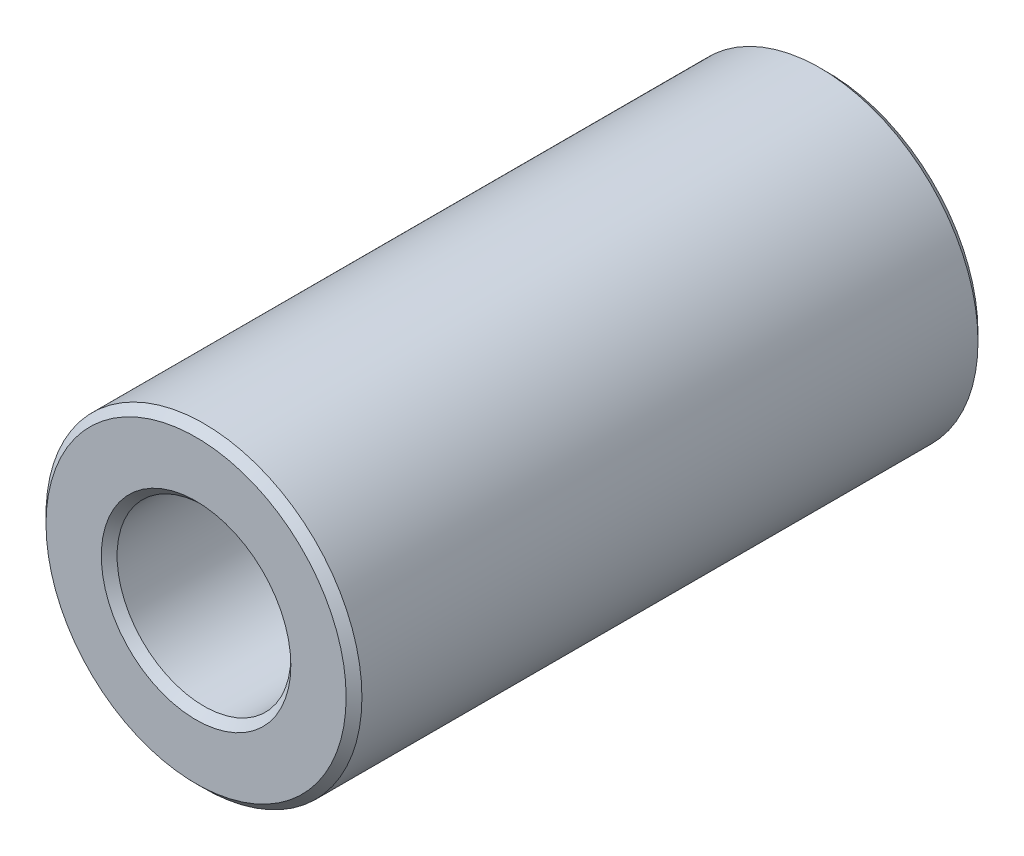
from build123d import *

# Parameters (mm, degrees)
SKETCH1_R           = 2
SKETCH1_R_2         = 1.1
BOSS_EXTRUDE2_DEPTH = 4
CHAMFER3_SIZE       = 0.1


with BuildPart() as part:
    # Sketch1 → Boss-Extrude2 (new, symmetric)
    with BuildSketch(Plane.XY):
        Circle(SKETCH1_R)
        Circle(SKETCH1_R_2, mode=Mode.SUBTRACT)
    extrude(amount=BOSS_EXTRUDE2_DEPTH, both=True)

    # Chamfer3
    chamfer3_edges = [part.edges().sort_by_distance(p)[0] for p in [
        (-2, 0, -4),
        (-2, 0, 4),
        (-1.1, 0, -4),
        (-1.1, 0, 4),
    ]]
    chamfer(chamfer3_edges, length=CHAMFER3_SIZE)


solid = part.part
